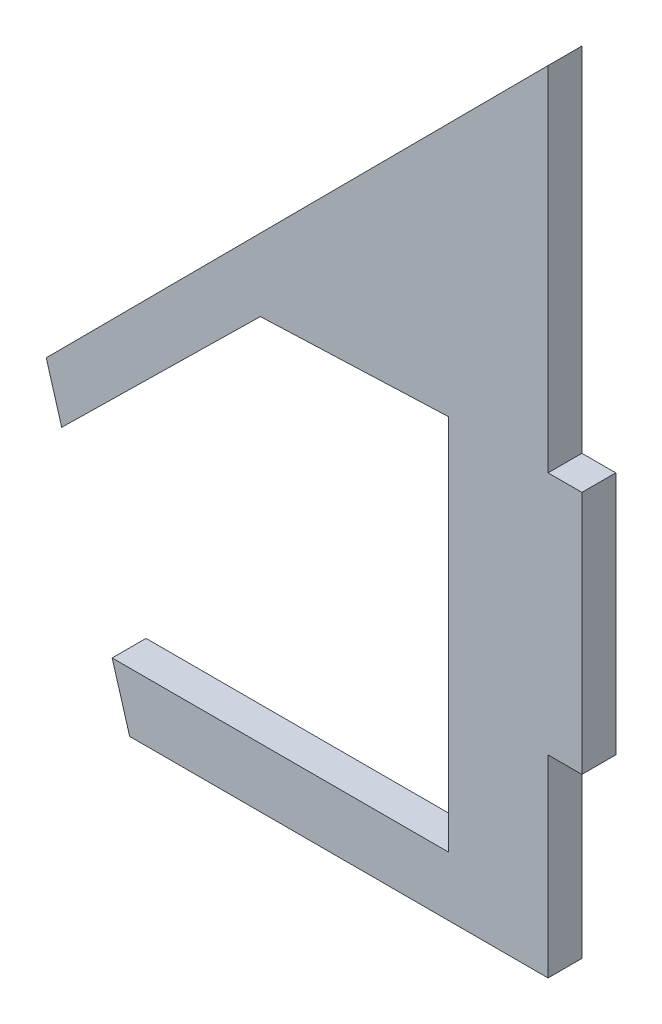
ISO-10303-21;
HEADER;
FILE_DESCRIPTION(('STEP AP214'),'2;1');
FILE_NAME('part.step','',(''),(''),'','','');
FILE_SCHEMA(('AUTOMOTIVE_DESIGN { 1 0 10303 214 1 1 1 1 }'));
ENDSEC;
DATA;
#1=APPLICATION_CONTEXT('core data for automotive mechanical design processes');
#2=APPLICATION_PROTOCOL_DEFINITION('international standard','automotive_design',2000,#1);
#3=PRODUCT_CONTEXT('',#1,'mechanical');
#4=PRODUCT('Part','Part','',(#3));
#5=PRODUCT_RELATED_PRODUCT_CATEGORY('part','',(#4));
#6=PRODUCT_DEFINITION_FORMATION('','',#4);
#7=PRODUCT_DEFINITION_CONTEXT('part definition',#1,'design');
#8=PRODUCT_DEFINITION('design','',#6,#7);
#9=PRODUCT_DEFINITION_SHAPE('','',#8);
#10=(LENGTH_UNIT() NAMED_UNIT(*) SI_UNIT(.MILLI.,.METRE.));
#11=(NAMED_UNIT(*) PLANE_ANGLE_UNIT() SI_UNIT($,.RADIAN.));
#12=(NAMED_UNIT(*) SI_UNIT($,.STERADIAN.) SOLID_ANGLE_UNIT());
#13=UNCERTAINTY_MEASURE_WITH_UNIT(LENGTH_MEASURE(1.E-05),#10,'distance_accuracy_value','');
#14=(GEOMETRIC_REPRESENTATION_CONTEXT(3) GLOBAL_UNCERTAINTY_ASSIGNED_CONTEXT((#13)) GLOBAL_UNIT_ASSIGNED_CONTEXT((#10,
#11,#12)) REPRESENTATION_CONTEXT('',''));
#15=CARTESIAN_POINT('',(0.,0.,0.));
#16=DIRECTION('',(0.,0.,1.));
#17=DIRECTION('',(1.,0.,0.));
#18=AXIS2_PLACEMENT_3D('',#15,#16,#17);
#19=CARTESIAN_POINT('',(0.,20.6513595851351,1.524));
#20=DIRECTION('',(0.,-1.,0.));
#21=DIRECTION('',(0.,0.,-1.));
#22=AXIS2_PLACEMENT_3D('',#19,#20,#21);
#23=PLANE('',#22);
#24=DIRECTION('',(-1.,0.,0.));
#25=VECTOR('',#24,1.);
#26=CARTESIAN_POINT('',(0.,20.6513595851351,0.));
#27=LINE('',#26,#25);
#28=CARTESIAN_POINT('',(0.628780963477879,20.6513595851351,0.));
#29=VERTEX_POINT('',#28);
#30=CARTESIAN_POINT('',(-0.895219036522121,20.6513595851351,0.));
#31=VERTEX_POINT('',#30);
#32=EDGE_CURVE('E161',#29,#31,#27,.T.);
#33=ORIENTED_EDGE('',*,*,#32,.F.);
#34=DIRECTION('',(0.,0.,-1.));
#35=VECTOR('',#34,1.);
#36=CARTESIAN_POINT('',(0.628780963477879,20.6513595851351,1.524));
#37=LINE('',#36,#35);
#38=CARTESIAN_POINT('',(0.628780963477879,20.6513595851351,1.524));
#39=VERTEX_POINT('',#38);
#40=EDGE_CURVE('E11',#39,#29,#37,.T.);
#41=ORIENTED_EDGE('',*,*,#40,.F.);
#42=DIRECTION('',(-1.,0.,0.));
#43=VECTOR('',#42,1.);
#44=CARTESIAN_POINT('',(0.,20.6513595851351,1.524));
#45=LINE('',#44,#43);
#46=CARTESIAN_POINT('',(-0.895219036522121,20.6513595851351,1.524));
#47=VERTEX_POINT('',#46);
#48=EDGE_CURVE('E188',#39,#47,#45,.T.);
#49=ORIENTED_EDGE('',*,*,#48,.T.);
#50=DIRECTION('',(0.,0.,-1.));
#51=VECTOR('',#50,1.);
#52=CARTESIAN_POINT('',(-0.895219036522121,20.6513595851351,1.524));
#53=LINE('',#52,#51);
#54=EDGE_CURVE('E104',#47,#31,#53,.T.);
#55=ORIENTED_EDGE('',*,*,#54,.T.);
#56=EDGE_LOOP('',(#33,#41,#49,#55));
#57=FACE_BOUND('',#56,.T.);
#58=ADVANCED_FACE('F38',(#57),#23,.T.);
#59=CARTESIAN_POINT('',(0.628780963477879,0.,1.524));
#60=DIRECTION('',(-1.,0.,0.));
#61=DIRECTION('',(0.,0.,1.));
#62=AXIS2_PLACEMENT_3D('',#59,#60,#61);
#63=PLANE('',#62);
#64=DIRECTION('',(0.,1.,0.));
#65=VECTOR('',#64,1.);
#66=CARTESIAN_POINT('',(0.628780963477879,0.,0.));
#67=LINE('',#66,#65);
#68=CARTESIAN_POINT('',(0.628780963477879,31.6450191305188,0.));
#69=VERTEX_POINT('',#68);
#70=EDGE_CURVE('E164',#29,#69,#67,.T.);
#71=ORIENTED_EDGE('',*,*,#70,.T.);
#72=DIRECTION('',(0.,0.,-1.));
#73=VECTOR('',#72,1.);
#74=CARTESIAN_POINT('',(0.628780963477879,31.6450191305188,1.524));
#75=LINE('',#74,#73);
#76=CARTESIAN_POINT('',(0.628780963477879,31.6450191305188,1.524));
#77=VERTEX_POINT('',#76);
#78=EDGE_CURVE('E46',#77,#69,#75,.T.);
#79=ORIENTED_EDGE('',*,*,#78,.F.);
#80=DIRECTION('',(0.,1.,0.));
#81=VECTOR('',#80,1.);
#82=CARTESIAN_POINT('',(0.628780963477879,0.,1.524));
#83=LINE('',#82,#81);
#84=EDGE_CURVE('E260',#39,#77,#83,.T.);
#85=ORIENTED_EDGE('',*,*,#84,.F.);
#86=ORIENTED_EDGE('',*,*,#40,.T.);
#87=EDGE_LOOP('',(#71,#79,#85,#86));
#88=FACE_BOUND('',#87,.T.);
#89=ADVANCED_FACE('F263',(#88),#63,.F.);
#90=CARTESIAN_POINT('',(0.,31.6450191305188,1.524));
#91=DIRECTION('',(0.,-1.,0.));
#92=DIRECTION('',(0.,0.,-1.));
#93=AXIS2_PLACEMENT_3D('',#90,#91,#92);
#94=PLANE('',#93);
#95=DIRECTION('',(-1.,0.,0.));
#96=VECTOR('',#95,1.);
#97=CARTESIAN_POINT('',(0.,31.6450191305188,0.));
#98=LINE('',#97,#96);
#99=CARTESIAN_POINT('',(-0.895219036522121,31.6450191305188,0.));
#100=VERTEX_POINT('',#99);
#101=EDGE_CURVE('E166',#69,#100,#98,.T.);
#102=ORIENTED_EDGE('',*,*,#101,.T.);
#103=DIRECTION('',(0.,0.,-1.));
#104=VECTOR('',#103,1.);
#105=CARTESIAN_POINT('',(-0.895219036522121,31.6450191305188,1.524));
#106=LINE('',#105,#104);
#107=CARTESIAN_POINT('',(-0.895219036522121,31.6450191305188,1.524));
#108=VERTEX_POINT('',#107);
#109=EDGE_CURVE('E208',#108,#100,#106,.T.);
#110=ORIENTED_EDGE('',*,*,#109,.F.);
#111=DIRECTION('',(-1.,0.,0.));
#112=VECTOR('',#111,1.);
#113=CARTESIAN_POINT('',(0.,31.6450191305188,1.524));
#114=LINE('',#113,#112);
#115=EDGE_CURVE('E217',#77,#108,#114,.T.);
#116=ORIENTED_EDGE('',*,*,#115,.F.);
#117=ORIENTED_EDGE('',*,*,#78,.T.);
#118=EDGE_LOOP('',(#102,#110,#116,#117));
#119=FACE_BOUND('',#118,.T.);
#120=ADVANCED_FACE('F215',(#119),#94,.F.);
#121=CARTESIAN_POINT('',(-0.895219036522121,0.,1.524));
#122=DIRECTION('',(-1.,0.,0.));
#123=DIRECTION('',(0.,0.,1.));
#124=AXIS2_PLACEMENT_3D('',#121,#122,#123);
#125=PLANE('',#124);
#126=DIRECTION('',(0.,1.,0.));
#127=VECTOR('',#126,1.);
#128=CARTESIAN_POINT('',(-0.895219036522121,0.,0.));
#129=LINE('',#128,#127);
#130=CARTESIAN_POINT('',(-0.895219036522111,47.5205174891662,0.));
#131=VERTEX_POINT('',#130);
#132=EDGE_CURVE('E168',#100,#131,#129,.T.);
#133=ORIENTED_EDGE('',*,*,#132,.T.);
#134=DIRECTION('',(0.,0.,-1.));
#135=VECTOR('',#134,1.);
#136=CARTESIAN_POINT('',(-0.895219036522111,47.5205174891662,1.524));
#137=LINE('',#136,#135);
#138=CARTESIAN_POINT('',(-0.895219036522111,47.5205174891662,1.524));
#139=VERTEX_POINT('',#138);
#140=EDGE_CURVE('E205',#139,#131,#137,.T.);
#141=ORIENTED_EDGE('',*,*,#140,.F.);
#142=DIRECTION('',(0.,1.,0.));
#143=VECTOR('',#142,1.);
#144=CARTESIAN_POINT('',(-0.895219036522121,0.,1.524));
#145=LINE('',#144,#143);
#146=EDGE_CURVE('E236',#108,#139,#145,.T.);
#147=ORIENTED_EDGE('',*,*,#146,.F.);
#148=ORIENTED_EDGE('',*,*,#109,.T.);
#149=EDGE_LOOP('',(#133,#141,#147,#148));
#150=FACE_BOUND('',#149,.T.);
#151=ADVANCED_FACE('F226',(#150),#125,.F.);
#152=CARTESIAN_POINT('',(-24.2095813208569,24.105144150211,1.524));
#153=DIRECTION('',(0.708633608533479,-0.705576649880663,0.));
#154=DIRECTION('',(0.705576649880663,0.708633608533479,0.));
#155=AXIS2_PLACEMENT_3D('',#152,#153,#154);
#156=PLANE('',#155);
#157=DIRECTION('',(-0.705576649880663,-0.708633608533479,0.));
#158=VECTOR('',#157,1.);
#159=CARTESIAN_POINT('',(-24.2095813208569,24.105144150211,0.));
#160=LINE('',#159,#158);
#161=CARTESIAN_POINT('',(-23.4827452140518,24.8351293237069,0.));
#162=VERTEX_POINT('',#161);
#163=EDGE_CURVE('E170',#131,#162,#160,.T.);
#164=ORIENTED_EDGE('',*,*,#163,.T.);
#165=DIRECTION('',(0.,0.,-1.));
#166=VECTOR('',#165,1.);
#167=CARTESIAN_POINT('',(-23.4827452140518,24.8351293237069,1.524));
#168=LINE('',#167,#166);
#169=CARTESIAN_POINT('',(-23.4827452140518,24.8351293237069,1.524));
#170=VERTEX_POINT('',#169);
#171=EDGE_CURVE('E203',#170,#162,#168,.T.);
#172=ORIENTED_EDGE('',*,*,#171,.F.);
#173=DIRECTION('',(-0.705576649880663,-0.708633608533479,0.));
#174=VECTOR('',#173,1.);
#175=CARTESIAN_POINT('',(-24.2095813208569,24.105144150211,1.524));
#176=LINE('',#175,#174);
#177=EDGE_CURVE('E232',#139,#170,#176,.T.);
#178=ORIENTED_EDGE('',*,*,#177,.F.);
#179=ORIENTED_EDGE('',*,*,#140,.T.);
#180=EDGE_LOOP('',(#164,#172,#178,#179));
#181=FACE_BOUND('',#180,.T.);
#182=ADVANCED_FACE('F230',(#181),#156,.F.);
#183=CARTESIAN_POINT('',(-14.856373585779,-4.38578356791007,1.524));
#184=DIRECTION('',(-0.959080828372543,-0.283132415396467,0.));
#185=DIRECTION('',(0.283132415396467,-0.959080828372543,0.));
#186=AXIS2_PLACEMENT_3D('',#183,#184,#185);
#187=PLANE('',#186);
#188=DIRECTION('',(-0.283132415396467,0.959080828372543,0.));
#189=VECTOR('',#188,1.);
#190=CARTESIAN_POINT('',(-14.856373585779,-4.38578356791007,0.));
#191=LINE('',#190,#189);
#192=CARTESIAN_POINT('',(-22.7855151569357,22.4733369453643,0.));
#193=VERTEX_POINT('',#192);
#194=EDGE_CURVE('E173',#193,#162,#191,.T.);
#195=ORIENTED_EDGE('',*,*,#194,.F.);
#196=DIRECTION('',(0.,0.,-1.));
#197=VECTOR('',#196,1.);
#198=CARTESIAN_POINT('',(-22.7855151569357,22.4733369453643,1.524));
#199=LINE('',#198,#197);
#200=CARTESIAN_POINT('',(-22.7855151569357,22.4733369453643,1.524));
#201=VERTEX_POINT('',#200);
#202=EDGE_CURVE('E201',#201,#193,#199,.T.);
#203=ORIENTED_EDGE('',*,*,#202,.F.);
#204=DIRECTION('',(-0.283132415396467,0.959080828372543,0.));
#205=VECTOR('',#204,1.);
#206=CARTESIAN_POINT('',(-14.856373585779,-4.38578356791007,1.524));
#207=LINE('',#206,#205);
#208=EDGE_CURVE('E235',#201,#170,#207,.T.);
#209=ORIENTED_EDGE('',*,*,#208,.T.);
#210=ORIENTED_EDGE('',*,*,#171,.T.);
#211=EDGE_LOOP('',(#195,#203,#209,#210));
#212=FACE_BOUND('',#211,.T.);
#213=ADVANCED_FACE('F275',(#212),#187,.T.);
#214=CARTESIAN_POINT('',(-22.4314224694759,22.8213791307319,1.524));
#215=DIRECTION('',(-0.700987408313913,0.713173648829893,0.));
#216=DIRECTION('',(-0.713173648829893,-0.700987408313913,0.));
#217=AXIS2_PLACEMENT_3D('',#214,#215,#216);
#218=PLANE('',#217);
#219=DIRECTION('',(0.713173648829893,0.700987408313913,0.));
#220=VECTOR('',#219,1.);
#221=CARTESIAN_POINT('',(-22.4314224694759,22.8213791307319,0.));
#222=LINE('',#221,#220);
#223=CARTESIAN_POINT('',(-13.8457567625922,31.2603386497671,0.));
#224=VERTEX_POINT('',#223);
#225=EDGE_CURVE('E176',#193,#224,#222,.T.);
#226=ORIENTED_EDGE('',*,*,#225,.T.);
#227=DIRECTION('',(0.,0.,-1.));
#228=VECTOR('',#227,1.);
#229=CARTESIAN_POINT('',(-13.8457567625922,31.2603386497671,1.524));
#230=LINE('',#229,#228);
#231=CARTESIAN_POINT('',(-13.8457567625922,31.2603386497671,1.524));
#232=VERTEX_POINT('',#231);
#233=EDGE_CURVE('E198',#232,#224,#230,.T.);
#234=ORIENTED_EDGE('',*,*,#233,.F.);
#235=DIRECTION('',(0.713173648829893,0.700987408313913,0.));
#236=VECTOR('',#235,1.);
#237=CARTESIAN_POINT('',(-22.4314224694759,22.8213791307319,1.524));
#238=LINE('',#237,#236);
#239=EDGE_CURVE('E238',#201,#232,#238,.T.);
#240=ORIENTED_EDGE('',*,*,#239,.F.);
#241=ORIENTED_EDGE('',*,*,#202,.T.);
#242=EDGE_LOOP('',(#226,#234,#240,#241));
#243=FACE_BOUND('',#242,.T.);
#244=ADVANCED_FACE('F278',(#243),#218,.F.);
#245=CARTESIAN_POINT('',(-1.24928613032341,31.7558875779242,1.524));
#246=DIRECTION('',(-0.0393098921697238,0.999227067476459,0.));
#247=DIRECTION('',(-0.99922706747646,-0.0393098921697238,0.));
#248=AXIS2_PLACEMENT_3D('',#245,#246,#247);
#249=PLANE('',#248);
#250=DIRECTION('',(0.999227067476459,0.0393098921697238,0.));
#251=VECTOR('',#250,1.);
#252=CARTESIAN_POINT('',(-1.24928613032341,31.7558875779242,0.));
#253=LINE('',#252,#251);
#254=CARTESIAN_POINT('',(-5.37670260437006,31.5935137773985,0.));
#255=VERTEX_POINT('',#254);
#256=EDGE_CURVE('E178',#224,#255,#253,.T.);
#257=ORIENTED_EDGE('',*,*,#256,.T.);
#258=DIRECTION('',(0.,0.,-1.));
#259=VECTOR('',#258,1.);
#260=CARTESIAN_POINT('',(-5.37670260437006,31.5935137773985,1.524));
#261=LINE('',#260,#259);
#262=CARTESIAN_POINT('',(-5.37670260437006,31.5935137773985,1.524));
#263=VERTEX_POINT('',#262);
#264=EDGE_CURVE('E195',#263,#255,#261,.T.);
#265=ORIENTED_EDGE('',*,*,#264,.F.);
#266=DIRECTION('',(0.999227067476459,0.0393098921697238,0.));
#267=VECTOR('',#266,1.);
#268=CARTESIAN_POINT('',(-1.24928613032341,31.7558875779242,1.524));
#269=LINE('',#268,#267);
#270=EDGE_CURVE('E244',#232,#263,#269,.T.);
#271=ORIENTED_EDGE('',*,*,#270,.F.);
#272=ORIENTED_EDGE('',*,*,#233,.T.);
#273=EDGE_LOOP('',(#257,#265,#271,#272));
#274=FACE_BOUND('',#273,.T.);
#275=ADVANCED_FACE('F282',(#274),#249,.F.);
#276=CARTESIAN_POINT('',(-5.37670260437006,0.,1.524));
#277=DIRECTION('',(1.,0.,0.));
#278=DIRECTION('',(0.,0.,-1.));
#279=AXIS2_PLACEMENT_3D('',#276,#277,#278);
#280=PLANE('',#279);
#281=DIRECTION('',(0.,-1.,0.));
#282=VECTOR('',#281,1.);
#283=CARTESIAN_POINT('',(-5.37670260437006,0.,0.));
#284=LINE('',#283,#282);
#285=CARTESIAN_POINT('',(-5.37670260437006,14.6207796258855,0.));
#286=VERTEX_POINT('',#285);
#287=EDGE_CURVE('E180',#255,#286,#284,.T.);
#288=ORIENTED_EDGE('',*,*,#287,.T.);
#289=DIRECTION('',(0.,0.,-1.));
#290=VECTOR('',#289,1.);
#291=CARTESIAN_POINT('',(-5.37670260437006,14.6207796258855,1.524));
#292=LINE('',#291,#290);
#293=CARTESIAN_POINT('',(-5.37670260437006,14.6207796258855,1.524));
#294=VERTEX_POINT('',#293);
#295=EDGE_CURVE('E192',#294,#286,#292,.T.);
#296=ORIENTED_EDGE('',*,*,#295,.F.);
#297=DIRECTION('',(0.,-1.,0.));
#298=VECTOR('',#297,1.);
#299=CARTESIAN_POINT('',(-5.37670260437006,0.,1.524));
#300=LINE('',#299,#298);
#301=EDGE_CURVE('E246',#263,#294,#300,.T.);
#302=ORIENTED_EDGE('',*,*,#301,.F.);
#303=ORIENTED_EDGE('',*,*,#264,.T.);
#304=EDGE_LOOP('',(#288,#296,#302,#303));
#305=FACE_BOUND('',#304,.T.);
#306=ADVANCED_FACE('F252',(#305),#280,.F.);
#307=CARTESIAN_POINT('',(0.,14.6207796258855,1.524));
#308=DIRECTION('',(0.,-1.,0.));
#309=DIRECTION('',(1.,0.,0.));
#310=AXIS2_PLACEMENT_3D('',#307,#308,#309);
#311=PLANE('',#310);
#312=DIRECTION('',(-1.,0.,0.));
#313=VECTOR('',#312,1.);
#314=CARTESIAN_POINT('',(0.,14.6207796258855,0.));
#315=LINE('',#314,#313);
#316=CARTESIAN_POINT('',(-20.5145757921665,14.6207796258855,0.));
#317=VERTEX_POINT('',#316);
#318=EDGE_CURVE('E182',#286,#317,#315,.T.);
#319=ORIENTED_EDGE('',*,*,#318,.T.);
#320=DIRECTION('',(0.,0.,-1.));
#321=VECTOR('',#320,1.);
#322=CARTESIAN_POINT('',(-20.5145757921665,14.6207796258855,1.524));
#323=LINE('',#322,#321);
#324=CARTESIAN_POINT('',(-20.5145757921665,14.6207796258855,1.524));
#325=VERTEX_POINT('',#324);
#326=EDGE_CURVE('E153',#325,#317,#323,.T.);
#327=ORIENTED_EDGE('',*,*,#326,.F.);
#328=DIRECTION('',(-1.,0.,0.));
#329=VECTOR('',#328,1.);
#330=CARTESIAN_POINT('',(0.,14.6207796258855,1.524));
#331=LINE('',#330,#329);
#332=EDGE_CURVE('E144',#294,#325,#331,.T.);
#333=ORIENTED_EDGE('',*,*,#332,.F.);
#334=ORIENTED_EDGE('',*,*,#295,.T.);
#335=EDGE_LOOP('',(#319,#327,#333,#334));
#336=FACE_BOUND('',#335,.T.);
#337=ADVANCED_FACE('F256',(#336),#311,.F.);
#338=CARTESIAN_POINT('',(-14.8998190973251,-4.39860921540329,1.524));
#339=DIRECTION('',(0.959080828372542,0.283132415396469,0.));
#340=DIRECTION('',(-0.283132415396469,0.959080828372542,0.));
#341=AXIS2_PLACEMENT_3D('',#338,#339,#340);
#342=PLANE('',#341);
#343=DIRECTION('',(0.283132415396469,-0.959080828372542,0.));
#344=VECTOR('',#343,1.);
#345=CARTESIAN_POINT('',(-14.8998190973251,-4.39860921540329,0.));
#346=LINE('',#345,#344);
#347=CARTESIAN_POINT('',(-19.7274518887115,11.9544814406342,0.));
#348=VERTEX_POINT('',#347);
#349=EDGE_CURVE('E152',#317,#348,#346,.T.);
#350=ORIENTED_EDGE('',*,*,#349,.T.);
#351=DIRECTION('',(0.,0.,-1.));
#352=VECTOR('',#351,1.);
#353=CARTESIAN_POINT('',(-19.7274518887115,11.9544814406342,1.524));
#354=LINE('',#353,#352);
#355=CARTESIAN_POINT('',(-19.7274518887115,11.9544814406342,1.524));
#356=VERTEX_POINT('',#355);
#357=EDGE_CURVE('E149',#356,#348,#354,.T.);
#358=ORIENTED_EDGE('',*,*,#357,.F.);
#359=DIRECTION('',(0.283132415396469,-0.959080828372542,0.));
#360=VECTOR('',#359,1.);
#361=CARTESIAN_POINT('',(-14.8998190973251,-4.39860921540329,1.524));
#362=LINE('',#361,#360);
#363=EDGE_CURVE('E138',#325,#356,#362,.T.);
#364=ORIENTED_EDGE('',*,*,#363,.F.);
#365=ORIENTED_EDGE('',*,*,#326,.T.);
#366=EDGE_LOOP('',(#350,#358,#364,#365));
#367=FACE_BOUND('',#366,.T.);
#368=ADVANCED_FACE('F150',(#367),#342,.F.);
#369=CARTESIAN_POINT('',(0.,11.9544814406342,1.524));
#370=DIRECTION('',(0.,1.,0.));
#371=DIRECTION('',(0.,0.,1.));
#372=AXIS2_PLACEMENT_3D('',#369,#370,#371);
#373=PLANE('',#372);
#374=DIRECTION('',(1.,0.,0.));
#375=VECTOR('',#374,1.);
#376=CARTESIAN_POINT('',(0.,11.9544814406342,0.));
#377=LINE('',#376,#375);
#378=CARTESIAN_POINT('',(-0.895219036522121,11.9544814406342,0.));
#379=VERTEX_POINT('',#378);
#380=EDGE_CURVE('E97',#348,#379,#377,.T.);
#381=ORIENTED_EDGE('',*,*,#380,.T.);
#382=DIRECTION('',(0.,0.,-1.));
#383=VECTOR('',#382,1.);
#384=CARTESIAN_POINT('',(-0.895219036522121,11.9544814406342,1.524));
#385=LINE('',#384,#383);
#386=CARTESIAN_POINT('',(-0.895219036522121,11.9544814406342,1.524));
#387=VERTEX_POINT('',#386);
#388=EDGE_CURVE('E154',#387,#379,#385,.T.);
#389=ORIENTED_EDGE('',*,*,#388,.F.);
#390=DIRECTION('',(1.,0.,0.));
#391=VECTOR('',#390,1.);
#392=CARTESIAN_POINT('',(0.,11.9544814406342,1.524));
#393=LINE('',#392,#391);
#394=EDGE_CURVE('E142',#356,#387,#393,.T.);
#395=ORIENTED_EDGE('',*,*,#394,.F.);
#396=ORIENTED_EDGE('',*,*,#357,.T.);
#397=EDGE_LOOP('',(#381,#389,#395,#396));
#398=FACE_BOUND('',#397,.T.);
#399=ADVANCED_FACE('F156',(#398),#373,.F.);
#400=CARTESIAN_POINT('',(-0.895219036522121,0.,1.524));
#401=DIRECTION('',(-1.,0.,0.));
#402=DIRECTION('',(0.,0.,1.));
#403=AXIS2_PLACEMENT_3D('',#400,#401,#402);
#404=PLANE('',#403);
#405=DIRECTION('',(0.,1.,0.));
#406=VECTOR('',#405,1.);
#407=CARTESIAN_POINT('',(-0.895219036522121,0.,0.));
#408=LINE('',#407,#406);
#409=EDGE_CURVE('E186',#379,#31,#408,.T.);
#410=ORIENTED_EDGE('',*,*,#409,.T.);
#411=ORIENTED_EDGE('',*,*,#54,.F.);
#412=DIRECTION('',(0.,1.,0.));
#413=VECTOR('',#412,1.);
#414=CARTESIAN_POINT('',(-0.895219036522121,0.,1.524));
#415=LINE('',#414,#413);
#416=EDGE_CURVE('E54',#387,#47,#415,.T.);
#417=ORIENTED_EDGE('',*,*,#416,.F.);
#418=ORIENTED_EDGE('',*,*,#388,.T.);
#419=EDGE_LOOP('',(#410,#411,#417,#418));
#420=FACE_BOUND('',#419,.T.);
#421=ADVANCED_FACE('F259',(#420),#404,.F.);
#422=CARTESIAN_POINT('',(0.,0.,1.524));
#423=DIRECTION('',(0.,0.,1.));
#424=DIRECTION('',(1.,0.,0.));
#425=AXIS2_PLACEMENT_3D('',#422,#423,#424);
#426=PLANE('',#425);
#427=ORIENTED_EDGE('',*,*,#48,.F.);
#428=ORIENTED_EDGE('',*,*,#84,.T.);
#429=ORIENTED_EDGE('',*,*,#115,.T.);
#430=ORIENTED_EDGE('',*,*,#146,.T.);
#431=ORIENTED_EDGE('',*,*,#177,.T.);
#432=ORIENTED_EDGE('',*,*,#208,.F.);
#433=ORIENTED_EDGE('',*,*,#239,.T.);
#434=ORIENTED_EDGE('',*,*,#270,.T.);
#435=ORIENTED_EDGE('',*,*,#301,.T.);
#436=ORIENTED_EDGE('',*,*,#332,.T.);
#437=ORIENTED_EDGE('',*,*,#363,.T.);
#438=ORIENTED_EDGE('',*,*,#394,.T.);
#439=ORIENTED_EDGE('',*,*,#416,.T.);
#440=EDGE_LOOP('',(#427,#428,#429,#430,#431,#432,#433,#434,#435,#436,#437,#438,#439));
#441=FACE_BOUND('',#440,.T.);
#442=ADVANCED_FACE('F140',(#441),#426,.T.);
#443=CARTESIAN_POINT('',(0.,0.,0.));
#444=DIRECTION('',(0.,0.,1.));
#445=DIRECTION('',(1.,0.,0.));
#446=AXIS2_PLACEMENT_3D('',#443,#444,#445);
#447=PLANE('',#446);
#448=ORIENTED_EDGE('',*,*,#32,.T.);
#449=ORIENTED_EDGE('',*,*,#409,.F.);
#450=ORIENTED_EDGE('',*,*,#380,.F.);
#451=ORIENTED_EDGE('',*,*,#349,.F.);
#452=ORIENTED_EDGE('',*,*,#318,.F.);
#453=ORIENTED_EDGE('',*,*,#287,.F.);
#454=ORIENTED_EDGE('',*,*,#256,.F.);
#455=ORIENTED_EDGE('',*,*,#225,.F.);
#456=ORIENTED_EDGE('',*,*,#194,.T.);
#457=ORIENTED_EDGE('',*,*,#163,.F.);
#458=ORIENTED_EDGE('',*,*,#132,.F.);
#459=ORIENTED_EDGE('',*,*,#101,.F.);
#460=ORIENTED_EDGE('',*,*,#70,.F.);
#461=EDGE_LOOP('',(#448,#449,#450,#451,#452,#453,#454,#455,#456,#457,#458,#459,#460));
#462=FACE_BOUND('',#461,.T.);
#463=ADVANCED_FACE('F222',(#462),#447,.F.);
#464=CLOSED_SHELL('',(#58,#89,#120,#151,#182,#213,#244,#275,#306,#337,#368,#399,#421,#442,#463));
#465=MANIFOLD_SOLID_BREP('B2',#464);
#466=ADVANCED_BREP_SHAPE_REPRESENTATION('',(#18,#465),#14);
#467=SHAPE_DEFINITION_REPRESENTATION(#9,#466);
ENDSEC;
END-ISO-10303-21;
